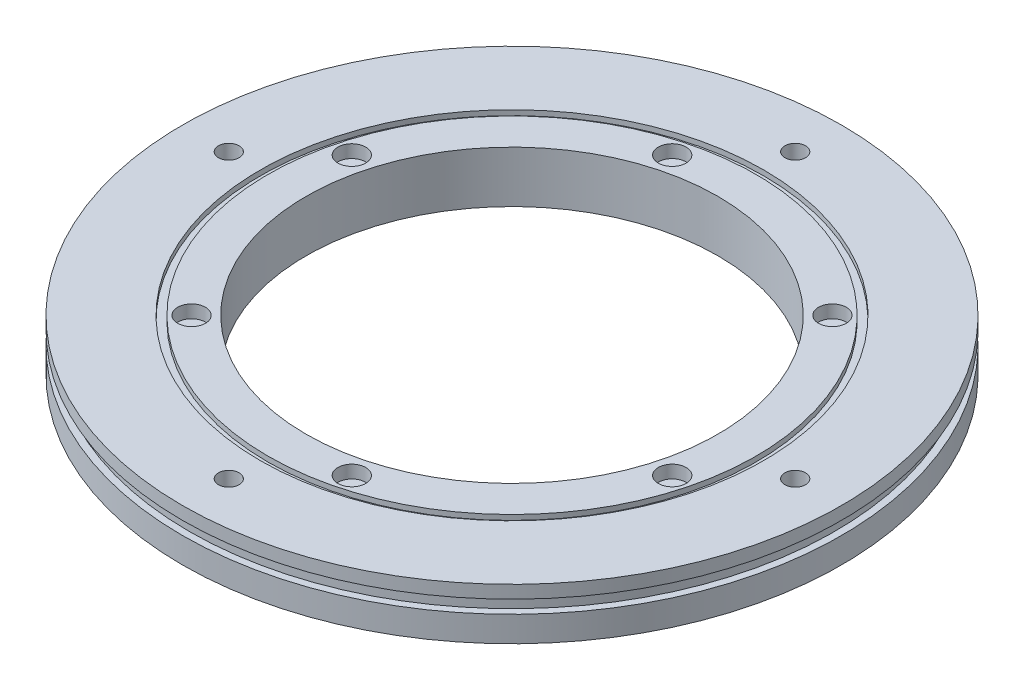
from build123d import *

# Parameters (mm, degrees)
SKETCH1_R              = 81.28
BOSS_EXTRUDE1_DEPTH    = 12.7
SKETCH2_R              = 50.8
CUT_EXTRUDE1_DEPTH     = 116.646732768
SKETCH3_R              = 6.35
CUT_EXTRUDE2_DEPTH     = 6.35
SKETCH4_R              = 101.6
SKETCH4_R_2            = 79.5782
CUT_EXTRUDE3_DEPTH     = 3.2258
SKETCH5_R              = 3.175
CUT_EXTRUDE4_DEPTH     = 7.62
F_10_CLEARANCE_HOLE1_D = 5.1054
SKETCH8_R              = 62.0903
SKETCH8_R_2            = 60.1853
CUT_EXTRUDE5_DEPTH     = 1.27
SKETCH9_R              = 3.429
CUT_EXTRUDE6_DEPTH     = 3.175


with BuildPart() as part:
    # Sketch1 → Boss-Extrude1 (new body)
    with BuildSketch(Plane(origin=(0, 0, 0), x_dir=(1, 0, 0), z_dir=(0, 1, 0))):
        with Locations(Location((0, 0, 0), (0, 0, 270))):
            Circle(SKETCH1_R)
    extrude(amount=BOSS_EXTRUDE1_DEPTH)

    # Sketch2 → Cut-Extrude1 (cut, through all)
    with BuildSketch(Plane(origin=(0, 12.7, 0), x_dir=(1, 0, 0), z_dir=(0, 1, 0))):
        with Locations(Location((0, 0, 0), (0, 0, 270))):
            Circle(SKETCH2_R)
    extrude(amount=-CUT_EXTRUDE1_DEPTH, mode=Mode.SUBTRACT)

    # Sketch3 → Cut-Extrude2 (cut)
    with BuildSketch(Plane(origin=(0, 0, 0), x_dir=(1, 0, 0), z_dir=(0, 1, 0))):
        with Locations(Location((0, 69.85, 0), (0, 0, 270))):
            Circle(SKETCH3_R)
        with Locations(Location((69.85, 0, 0), (0, 0, 270))):
            Circle(SKETCH3_R)
        with Locations(Location((0, -69.85, 0), (0, 0, 270))):
            Circle(SKETCH3_R)
        with Locations(Location((-69.85, 0, 0), (0, 0, 270))):
            Circle(SKETCH3_R)
    extrude(amount=CUT_EXTRUDE2_DEPTH, mode=Mode.SUBTRACT)

    # Sketch4 → Cut-Extrude3 (cut)
    with BuildSketch(Plane(origin=(0, 9.525, 0), x_dir=(1, 0, 0), z_dir=(0, 1, 0))):
        Circle(SKETCH4_R)
        with Locations(Location((0, 0, 0), (0, 0, 270))):
            Circle(SKETCH4_R_2, mode=Mode.SUBTRACT)
    extrude(amount=-CUT_EXTRUDE3_DEPTH, mode=Mode.SUBTRACT)

    # Sketch5 → Cut-Extrude4 (cut)
    with BuildSketch(Plane.XZ):
        with Locations(Location((-39.513126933, 39.513126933, 0), (0, 0, 270))):
            Circle(SKETCH5_R)
        with Locations(Location((14.46280824, 53.975935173, 0), (0, 0, 270))):
            Circle(SKETCH5_R)
        with Locations(Location((53.975935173, 14.46280824, 0), (0, 0, 270))):
            Circle(SKETCH5_R)
        with Locations(Location((39.513126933, -39.513126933, 0), (0, 0, 270))):
            Circle(SKETCH5_R)
        with Locations(Location((-14.46280824, -53.975935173, 0), (0, 0, 270))):
            Circle(SKETCH5_R)
        with Locations(Location((-53.975935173, -14.46280824, 0), (0, 0, 270))):
            Circle(SKETCH5_R)
    extrude(amount=-CUT_EXTRUDE4_DEPTH, mode=Mode.SUBTRACT)

    # 10 Clearance Hole1 (through all)
    with Locations(Plane(origin=(0, 6.35, 0), x_dir=(-1, 0, 0), z_dir=(0, -1, 0))):
        with Locations((0, 69.85), (69.85, 0), (0, -69.85), (-69.85, 0)):
            Hole(F_10_CLEARANCE_HOLE1_D / 2)

    # Sketch8 → Cut-Extrude5 (cut)
    with BuildSketch(Plane(origin=(0, 12.7, 0), x_dir=(1, 0, 0), z_dir=(0, 1, 0))):
        with Locations(Location((0, 0, 0), (0, 0, 270))):
            Circle(SKETCH8_R)
        with Locations(Location((0, 0, 0), (0, 0, 270))):
            Circle(SKETCH8_R_2, mode=Mode.SUBTRACT)
    extrude(amount=-CUT_EXTRUDE5_DEPTH, mode=Mode.SUBTRACT)

    # Sketch9 → Cut-Extrude6 (cut)
    with BuildSketch(Plane(origin=(0, 12.7, 0), x_dir=(1, 0, 0), z_dir=(0, 1, 0))):
        with Locations(Location((53.975935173, -14.46280824, 0), (0, 0, 270))):
            Circle(SKETCH9_R)
        with Locations(Location((14.46280824, -53.975935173, 0), (0, 0, 270))):
            Circle(SKETCH9_R)
        with Locations(Location((-39.513126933, -39.513126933, 0), (0, 0, 270))):
            Circle(SKETCH9_R)
        with Locations(Location((-53.975935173, 14.46280824, 0), (0, 0, 270))):
            Circle(SKETCH9_R)
        with Locations(Location((-14.46280824, 53.975935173, 0), (0, 0, 270))):
            Circle(SKETCH9_R)
        with Locations(Location((39.513126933, 39.513126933, 0), (0, 0, 270))):
            Circle(SKETCH9_R)
    extrude(amount=-CUT_EXTRUDE6_DEPTH, mode=Mode.SUBTRACT)


solid = part.part
